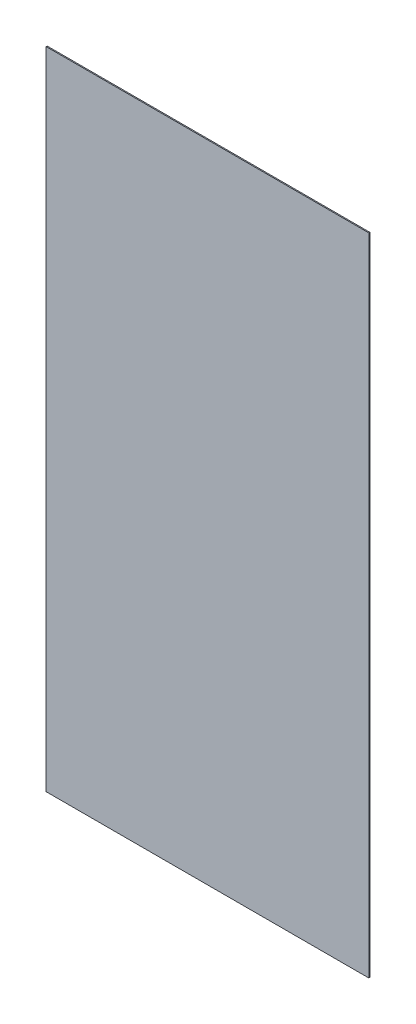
from build123d import *

# Parameters (mm, degrees)
SKETCH1_W           = 1220
SKETCH1_H           = 2440
BOSS_EXTRUDE1_DEPTH = 4


with BuildPart() as part:
    # Sketch1 → Boss-Extrude1 (new body)
    with BuildSketch(Plane.XY):
        with Locations((610, 1220)):
            Rectangle(SKETCH1_W, SKETCH1_H)
    extrude(amount=BOSS_EXTRUDE1_DEPTH)


solid = part.part
